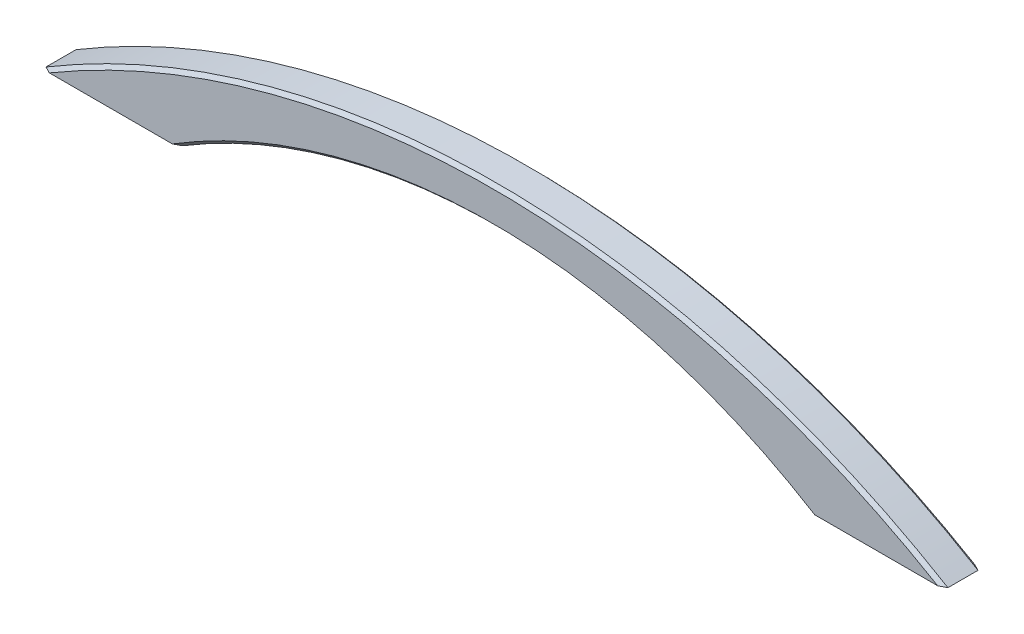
ISO-10303-21;
HEADER;
FILE_DESCRIPTION(('STEP AP214'),'2;1');
FILE_NAME('part.step','',(''),(''),'','','');
FILE_SCHEMA(('AUTOMOTIVE_DESIGN { 1 0 10303 214 1 1 1 1 }'));
ENDSEC;
DATA;
#1=APPLICATION_CONTEXT('core data for automotive mechanical design processes');
#2=APPLICATION_PROTOCOL_DEFINITION('international standard','automotive_design',2000,#1);
#3=PRODUCT_CONTEXT('',#1,'mechanical');
#4=PRODUCT('Part','Part','',(#3));
#5=PRODUCT_RELATED_PRODUCT_CATEGORY('part','',(#4));
#6=PRODUCT_DEFINITION_FORMATION('','',#4);
#7=PRODUCT_DEFINITION_CONTEXT('part definition',#1,'design');
#8=PRODUCT_DEFINITION('design','',#6,#7);
#9=PRODUCT_DEFINITION_SHAPE('','',#8);
#10=(LENGTH_UNIT() NAMED_UNIT(*) SI_UNIT(.MILLI.,.METRE.));
#11=(NAMED_UNIT(*) PLANE_ANGLE_UNIT() SI_UNIT($,.RADIAN.));
#12=(NAMED_UNIT(*) SI_UNIT($,.STERADIAN.) SOLID_ANGLE_UNIT());
#13=UNCERTAINTY_MEASURE_WITH_UNIT(LENGTH_MEASURE(1.E-05),#10,'distance_accuracy_value','');
#14=(GEOMETRIC_REPRESENTATION_CONTEXT(3) GLOBAL_UNCERTAINTY_ASSIGNED_CONTEXT((#13)) GLOBAL_UNIT_ASSIGNED_CONTEXT((#10,
#11,#12)) REPRESENTATION_CONTEXT('',''));
#15=CARTESIAN_POINT('',(0.,0.,0.));
#16=DIRECTION('',(0.,0.,1.));
#17=DIRECTION('',(1.,0.,0.));
#18=AXIS2_PLACEMENT_3D('',#15,#16,#17);
#19=CARTESIAN_POINT('',(0.,-112.184210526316,4.));
#20=DIRECTION('',(0.,0.,-1.));
#21=DIRECTION('',(-1.,0.,0.));
#22=AXIS2_PLACEMENT_3D('',#19,#20,#21);
#23=CYLINDRICAL_SURFACE('',#22,131.184210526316);
#24=DIRECTION('',(0.,0.,-1.));
#25=VECTOR('',#24,1.);
#26=CARTESIAN_POINT('',(-68.,0.,4.));
#27=LINE('',#26,#25);
#28=CARTESIAN_POINT('',(-68.,0.,3.24999999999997));
#29=VERTEX_POINT('',#28);
#30=CARTESIAN_POINT('',(-68.,0.,-3.25));
#31=VERTEX_POINT('',#30);
#32=EDGE_CURVE('E150',#29,#31,#27,.T.);
#33=ORIENTED_EDGE('',*,*,#32,.T.);
#34=CARTESIAN_POINT('',(0.,-112.184210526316,-3.25));
#35=DIRECTION('',(0.,0.,-1.));
#36=DIRECTION('',(-1.,0.,0.));
#37=AXIS2_PLACEMENT_3D('',#34,#35,#36);
#38=CIRCLE('',#37,131.184210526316);
#39=CARTESIAN_POINT('',(68.,0.,-3.25));
#40=VERTEX_POINT('',#39);
#41=EDGE_CURVE('E174',#31,#40,#38,.T.);
#42=ORIENTED_EDGE('',*,*,#41,.T.);
#43=DIRECTION('',(0.,0.,-1.));
#44=VECTOR('',#43,1.);
#45=CARTESIAN_POINT('',(68.,0.,4.));
#46=LINE('',#45,#44);
#47=CARTESIAN_POINT('',(68.,0.,3.24999999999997));
#48=VERTEX_POINT('',#47);
#49=EDGE_CURVE('E167',#48,#40,#46,.T.);
#50=ORIENTED_EDGE('',*,*,#49,.F.);
#51=CARTESIAN_POINT('',(0.,-112.184210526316,3.24999999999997));
#52=DIRECTION('',(0.,0.,-1.));
#53=DIRECTION('',(-1.,0.,0.));
#54=AXIS2_PLACEMENT_3D('',#51,#52,#53);
#55=CIRCLE('',#54,131.184210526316);
#56=EDGE_CURVE('E171',#48,#29,#55,.F.);
#57=ORIENTED_EDGE('',*,*,#56,.T.);
#58=EDGE_LOOP('',(#33,#42,#50,#57));
#59=FACE_BOUND('',#58,.T.);
#60=ADVANCED_FACE('F42',(#59),#23,.F.);
#61=CARTESIAN_POINT('',(97.5,0.,4.));
#62=DIRECTION('',(0.,1.,0.));
#63=DIRECTION('',(-1.,0.,0.));
#64=AXIS2_PLACEMENT_3D('',#61,#62,#63);
#65=PLANE('',#64);
#66=CARTESIAN_POINT('',(75.,1.09878299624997E-13,0.));
#67=DIRECTION('',(0.,-1.,0.));
#68=DIRECTION('',(0.,0.,-1.));
#69=AXIS2_PLACEMENT_3D('',#66,#67,#68);
#70=CIRCLE('',#69,1.64999999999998);
#71=CARTESIAN_POINT('',(75.,1.09878299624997E-13,-1.64999999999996));
#72=VERTEX_POINT('',#71);
#73=EDGE_CURVE('E126',#72,#72,#70,.T.);
#74=ORIENTED_EDGE('',*,*,#73,.F.);
#75=EDGE_LOOP('',(#74));
#76=FACE_BOUND('',#75,.T.);
#77=ORIENTED_EDGE('',*,*,#49,.T.);
#78=CARTESIAN_POINT('',(68.,0.,-3.25));
#79=CARTESIAN_POINT('',(68.2396998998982,0.,-3.37425391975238));
#80=CARTESIAN_POINT('',(68.4792049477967,0.,-3.49888088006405));
#81=CARTESIAN_POINT('',(68.957825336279,0.,-3.74888088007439));
#82=CARTESIAN_POINT('',(69.1969406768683,0.,-3.87425391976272));
#83=CARTESIAN_POINT('',(69.4358611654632,0.,-4.00000000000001));
#84=B_SPLINE_CURVE_WITH_KNOTS('',3,(#78,#79,#80,#81,#82,#83),.UNSPECIFIED.,.F.,.F.,(4,2,4),(0.,
0.809969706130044,1.61993940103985),.UNSPECIFIED.);
#85=CARTESIAN_POINT('',(69.4358611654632,0.,-4.));
#86=VERTEX_POINT('',#85);
#87=EDGE_CURVE('E212',#40,#86,#84,.T.);
#88=ORIENTED_EDGE('',*,*,#87,.T.);
#89=DIRECTION('',(1.,0.,0.));
#90=VECTOR('',#89,1.);
#91=CARTESIAN_POINT('',(97.5,0.,-4.));
#92=LINE('',#91,#90);
#93=CARTESIAN_POINT('',(96.033848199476,0.,-4.));
#94=VERTEX_POINT('',#93);
#95=EDGE_CURVE('E140',#86,#94,#92,.T.);
#96=ORIENTED_EDGE('',*,*,#95,.T.);
#97=CARTESIAN_POINT('',(96.033848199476,0.,-4.));
#98=CARTESIAN_POINT('',(96.2784903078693,0.,-3.87555415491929));
#99=CARTESIAN_POINT('',(96.5229906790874,0.,-3.75083123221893));
#100=CARTESIAN_POINT('',(97.0117079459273,0.,-3.5008312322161));
#101=CARTESIAN_POINT('',(97.2559248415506,0.,-3.37555415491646));
#102=CARTESIAN_POINT('',(97.5,0.,-3.25));
#103=B_SPLINE_CURVE_WITH_KNOTS('',3,(#97,#98,#99,#100,#101,#102),.UNSPECIFIED.,.F.,.F.,(4,2,4),
(0.,0.823423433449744,1.64684686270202),.UNSPECIFIED.);
#104=CARTESIAN_POINT('',(97.5,0.,-3.25000000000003));
#105=VERTEX_POINT('',#104);
#106=EDGE_CURVE('E186',#94,#105,#103,.T.);
#107=ORIENTED_EDGE('',*,*,#106,.T.);
#108=DIRECTION('',(0.,0.,-1.));
#109=VECTOR('',#108,1.);
#110=CARTESIAN_POINT('',(97.5,0.,4.));
#111=LINE('',#110,#109);
#112=CARTESIAN_POINT('',(97.5,0.,3.25000000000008));
#113=VERTEX_POINT('',#112);
#114=EDGE_CURVE('E163',#113,#105,#111,.T.);
#115=ORIENTED_EDGE('',*,*,#114,.F.);
#116=CARTESIAN_POINT('',(97.5,0.,3.25000000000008));
#117=CARTESIAN_POINT('',(97.2559248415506,0.,3.37555415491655));
#118=CARTESIAN_POINT('',(97.0117079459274,0.,3.50083123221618));
#119=CARTESIAN_POINT('',(96.5229906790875,0.,3.75083123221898));
#120=CARTESIAN_POINT('',(96.2784903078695,0.,3.87555415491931));
#121=CARTESIAN_POINT('',(96.0338481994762,0.,3.99999999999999));
#122=B_SPLINE_CURVE_WITH_KNOTS('',3,(#116,#117,#118,#119,#120,#121),.UNSPECIFIED.,.F.,.F.,(4,2,
4),(0.,0.823423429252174,1.64684686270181),.UNSPECIFIED.);
#123=CARTESIAN_POINT('',(96.0338481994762,0.,4.));
#124=VERTEX_POINT('',#123);
#125=EDGE_CURVE('E178',#113,#124,#122,.T.);
#126=ORIENTED_EDGE('',*,*,#125,.T.);
#127=DIRECTION('',(1.,0.,0.));
#128=VECTOR('',#127,1.);
#129=CARTESIAN_POINT('',(97.5,0.,4.));
#130=LINE('',#129,#128);
#131=CARTESIAN_POINT('',(69.4358611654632,0.,4.));
#132=VERTEX_POINT('',#131);
#133=EDGE_CURVE('E141',#132,#124,#130,.T.);
#134=ORIENTED_EDGE('',*,*,#133,.F.);
#135=CARTESIAN_POINT('',(69.4358611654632,0.,4.));
#136=CARTESIAN_POINT('',(69.1969406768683,0.,3.87425391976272));
#137=CARTESIAN_POINT('',(68.957825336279,0.,3.74888088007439));
#138=CARTESIAN_POINT('',(68.4792049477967,0.,3.49888088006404));
#139=CARTESIAN_POINT('',(68.2396998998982,0.,3.37425391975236));
#140=CARTESIAN_POINT('',(68.,0.,3.24999999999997));
#141=B_SPLINE_CURVE_WITH_KNOTS('',3,(#135,#136,#137,#138,#139,#140),.UNSPECIFIED.,.F.,.F.,(4,2,
4),(0.,0.809969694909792,1.61993940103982),.UNSPECIFIED.);
#142=EDGE_CURVE('E205',#132,#48,#141,.T.);
#143=ORIENTED_EDGE('',*,*,#142,.T.);
#144=EDGE_LOOP('',(#77,#88,#96,#107,#115,#126,#134,#143));
#145=FACE_BOUND('',#144,.T.);
#146=ADVANCED_FACE('F192',(#76,#145),#65,.F.);
#147=CARTESIAN_POINT('',(0.,-162.541666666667,4.));
#148=DIRECTION('',(0.,0.,-1.));
#149=DIRECTION('',(-1.,0.,0.));
#150=AXIS2_PLACEMENT_3D('',#147,#148,#149);
#151=CYLINDRICAL_SURFACE('',#150,189.541666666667);
#152=ORIENTED_EDGE('',*,*,#114,.T.);
#153=CARTESIAN_POINT('',(0.,-162.541666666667,-3.25000000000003));
#154=DIRECTION('',(0.,0.,-1.));
#155=DIRECTION('',(-1.,0.,0.));
#156=AXIS2_PLACEMENT_3D('',#153,#154,#155);
#157=CIRCLE('',#156,189.541666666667);
#158=CARTESIAN_POINT('',(-97.5,0.,-3.25000000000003));
#159=VERTEX_POINT('',#158);
#160=EDGE_CURVE('E11',#105,#159,#157,.F.);
#161=ORIENTED_EDGE('',*,*,#160,.T.);
#162=DIRECTION('',(0.,0.,-1.));
#163=VECTOR('',#162,1.);
#164=CARTESIAN_POINT('',(-97.5,0.,4.));
#165=LINE('',#164,#163);
#166=CARTESIAN_POINT('',(-97.5,0.,3.25000000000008));
#167=VERTEX_POINT('',#166);
#168=EDGE_CURVE('E160',#167,#159,#165,.T.);
#169=ORIENTED_EDGE('',*,*,#168,.F.);
#170=CARTESIAN_POINT('',(0.,-162.541666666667,3.25000000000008));
#171=DIRECTION('',(0.,0.,-1.));
#172=DIRECTION('',(-1.,0.,0.));
#173=AXIS2_PLACEMENT_3D('',#170,#171,#172);
#174=CIRCLE('',#173,189.541666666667);
#175=EDGE_CURVE('E53',#167,#113,#174,.T.);
#176=ORIENTED_EDGE('',*,*,#175,.T.);
#177=EDGE_LOOP('',(#152,#161,#169,#176));
#178=FACE_BOUND('',#177,.T.);
#179=ADVANCED_FACE('F197',(#178),#151,.T.);
#180=CARTESIAN_POINT('',(-68.,0.,4.));
#181=DIRECTION('',(0.,1.,0.));
#182=DIRECTION('',(-1.,0.,0.));
#183=AXIS2_PLACEMENT_3D('',#180,#181,#182);
#184=PLANE('',#183);
#185=CARTESIAN_POINT('',(-75.,-1.12584769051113E-13,0.));
#186=DIRECTION('',(0.,-1.,0.));
#187=DIRECTION('',(0.,0.,-1.));
#188=AXIS2_PLACEMENT_3D('',#185,#186,#187);
#189=CIRCLE('',#188,1.64999999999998);
#190=CARTESIAN_POINT('',(-75.,-1.12584769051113E-13,-1.64999999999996));
#191=VERTEX_POINT('',#190);
#192=EDGE_CURVE('E127',#191,#191,#189,.T.);
#193=ORIENTED_EDGE('',*,*,#192,.F.);
#194=EDGE_LOOP('',(#193));
#195=FACE_BOUND('',#194,.T.);
#196=DIRECTION('',(1.,0.,0.));
#197=VECTOR('',#196,1.);
#198=CARTESIAN_POINT('',(-68.,0.,-4.));
#199=LINE('',#198,#197);
#200=CARTESIAN_POINT('',(-96.033848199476,0.,-4.));
#201=VERTEX_POINT('',#200);
#202=CARTESIAN_POINT('',(-69.4358611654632,0.,-4.));
#203=VERTEX_POINT('',#202);
#204=EDGE_CURVE('E146',#201,#203,#199,.T.);
#205=ORIENTED_EDGE('',*,*,#204,.T.);
#206=CARTESIAN_POINT('',(-69.4358611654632,0.,-4.));
#207=CARTESIAN_POINT('',(-69.1969406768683,0.,-3.87425391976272));
#208=CARTESIAN_POINT('',(-68.957825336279,0.,-3.74888088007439));
#209=CARTESIAN_POINT('',(-68.4792049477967,0.,-3.49888088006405));
#210=CARTESIAN_POINT('',(-68.2396998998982,0.,-3.37425391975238));
#211=CARTESIAN_POINT('',(-68.,0.,-3.25));
#212=B_SPLINE_CURVE_WITH_KNOTS('',3,(#206,#207,#208,#209,#210,#211),.UNSPECIFIED.,.F.,.F.,(4,2,
4),(0.,0.809969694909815,1.61993940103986),.UNSPECIFIED.);
#213=EDGE_CURVE('E241',#203,#31,#212,.T.);
#214=ORIENTED_EDGE('',*,*,#213,.T.);
#215=ORIENTED_EDGE('',*,*,#32,.F.);
#216=CARTESIAN_POINT('',(-68.,0.,3.24999999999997));
#217=CARTESIAN_POINT('',(-68.2396998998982,0.,3.37425391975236));
#218=CARTESIAN_POINT('',(-68.4792049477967,0.,3.49888088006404));
#219=CARTESIAN_POINT('',(-68.957825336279,0.,3.74888088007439));
#220=CARTESIAN_POINT('',(-69.1969406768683,0.,3.87425391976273));
#221=CARTESIAN_POINT('',(-69.4358611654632,0.,4.00000000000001));
#222=B_SPLINE_CURVE_WITH_KNOTS('',3,(#216,#217,#218,#219,#220,#221),.UNSPECIFIED.,.F.,.F.,(4,2,
4),(0.,0.809969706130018,1.61993940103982),.UNSPECIFIED.);
#223=CARTESIAN_POINT('',(-69.4358611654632,0.,4.));
#224=VERTEX_POINT('',#223);
#225=EDGE_CURVE('E233',#29,#224,#222,.T.);
#226=ORIENTED_EDGE('',*,*,#225,.T.);
#227=DIRECTION('',(1.,0.,0.));
#228=VECTOR('',#227,1.);
#229=CARTESIAN_POINT('',(-68.,0.,4.));
#230=LINE('',#229,#228);
#231=CARTESIAN_POINT('',(-96.0338481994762,0.,4.));
#232=VERTEX_POINT('',#231);
#233=EDGE_CURVE('E145',#232,#224,#230,.T.);
#234=ORIENTED_EDGE('',*,*,#233,.F.);
#235=CARTESIAN_POINT('',(-96.0338481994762,0.,4.));
#236=CARTESIAN_POINT('',(-96.2784903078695,0.,3.8755541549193));
#237=CARTESIAN_POINT('',(-96.5229906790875,0.,3.75083123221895));
#238=CARTESIAN_POINT('',(-97.0117079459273,0.,3.50083123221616));
#239=CARTESIAN_POINT('',(-97.2559248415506,0.,3.37555415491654));
#240=CARTESIAN_POINT('',(-97.5,0.,3.25000000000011));
#241=B_SPLINE_CURVE_WITH_KNOTS('',3,(#235,#236,#237,#238,#239,#240),.UNSPECIFIED.,.F.,.F.,(4,2,
4),(0.,0.823423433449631,1.64684686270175),.UNSPECIFIED.);
#242=EDGE_CURVE('E67',#232,#167,#241,.T.);
#243=ORIENTED_EDGE('',*,*,#242,.T.);
#244=ORIENTED_EDGE('',*,*,#168,.T.);
#245=CARTESIAN_POINT('',(-97.5,0.,-3.25000000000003));
#246=CARTESIAN_POINT('',(-97.2559248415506,0.,-3.37555415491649));
#247=CARTESIAN_POINT('',(-97.0117079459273,0.,-3.50083123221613));
#248=CARTESIAN_POINT('',(-96.5229906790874,0.,-3.75083123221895));
#249=CARTESIAN_POINT('',(-96.2784903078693,0.,-3.87555415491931));
#250=CARTESIAN_POINT('',(-96.033848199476,0.,-4.00000000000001));
#251=B_SPLINE_CURVE_WITH_KNOTS('',3,(#245,#246,#247,#248,#249,#250),.UNSPECIFIED.,.F.,.F.,(4,2,
4),(0.,0.823423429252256,1.646846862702),.UNSPECIFIED.);
#252=EDGE_CURVE('E60',#159,#201,#251,.T.);
#253=ORIENTED_EDGE('',*,*,#252,.T.);
#254=EDGE_LOOP('',(#205,#214,#215,#226,#234,#243,#244,#253));
#255=FACE_BOUND('',#254,.T.);
#256=ADVANCED_FACE('F252',(#195,#255),#184,.F.);
#257=CARTESIAN_POINT('',(0.,-112.184210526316,4.));
#258=DIRECTION('',(0.,0.,-1.));
#259=DIRECTION('',(-1.,0.,0.));
#260=AXIS2_PLACEMENT_3D('',#257,#258,#259);
#261=PLANE('',#260);
#262=ORIENTED_EDGE('',*,*,#233,.T.);
#263=CARTESIAN_POINT('',(0.,-112.184210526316,4.));
#264=DIRECTION('',(0.,0.,-1.));
#265=DIRECTION('',(-1.,0.,0.));
#266=AXIS2_PLACEMENT_3D('',#263,#264,#265);
#267=CIRCLE('',#266,131.934210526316);
#268=EDGE_CURVE('E289',#224,#132,#267,.T.);
#269=ORIENTED_EDGE('',*,*,#268,.T.);
#270=ORIENTED_EDGE('',*,*,#133,.T.);
#271=CARTESIAN_POINT('',(0.,-162.541666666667,4.));
#272=DIRECTION('',(0.,0.,-1.));
#273=DIRECTION('',(-1.,0.,0.));
#274=AXIS2_PLACEMENT_3D('',#271,#272,#273);
#275=CIRCLE('',#274,188.791666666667);
#276=EDGE_CURVE('E286',#124,#232,#275,.F.);
#277=ORIENTED_EDGE('',*,*,#276,.T.);
#278=EDGE_LOOP('',(#262,#269,#270,#277));
#279=FACE_BOUND('',#278,.T.);
#280=ADVANCED_FACE('F256',(#279),#261,.F.);
#281=CARTESIAN_POINT('',(0.,-112.184210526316,-4.));
#282=DIRECTION('',(0.,0.,-1.));
#283=DIRECTION('',(-1.,0.,0.));
#284=AXIS2_PLACEMENT_3D('',#281,#282,#283);
#285=PLANE('',#284);
#286=ORIENTED_EDGE('',*,*,#95,.F.);
#287=CARTESIAN_POINT('',(0.,-112.184210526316,-4.));
#288=DIRECTION('',(0.,0.,-1.));
#289=DIRECTION('',(-1.,0.,0.));
#290=AXIS2_PLACEMENT_3D('',#287,#288,#289);
#291=CIRCLE('',#290,131.934210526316);
#292=EDGE_CURVE('E269',#86,#203,#291,.F.);
#293=ORIENTED_EDGE('',*,*,#292,.T.);
#294=ORIENTED_EDGE('',*,*,#204,.F.);
#295=CARTESIAN_POINT('',(0.,-162.541666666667,-4.));
#296=DIRECTION('',(0.,0.,-1.));
#297=DIRECTION('',(-1.,0.,0.));
#298=AXIS2_PLACEMENT_3D('',#295,#296,#297);
#299=CIRCLE('',#298,188.791666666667);
#300=EDGE_CURVE('E271',#201,#94,#299,.T.);
#301=ORIENTED_EDGE('',*,*,#300,.T.);
#302=EDGE_LOOP('',(#286,#293,#294,#301));
#303=FACE_BOUND('',#302,.T.);
#304=ADVANCED_FACE('F258',(#303),#285,.T.);
#305=CARTESIAN_POINT('',(75.,6.00000000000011,0.));
#306=DIRECTION('',(0.,-1.,0.));
#307=DIRECTION('',(0.,0.,-1.));
#308=AXIS2_PLACEMENT_3D('',#305,#306,#307);
#309=CONICAL_SURFACE('',#308,1.65,1.02974425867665);
#310=CARTESIAN_POINT('',(75.,6.99142002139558,0.));
#311=VERTEX_POINT('',#310);
#312=VERTEX_LOOP('',#311);
#313=FACE_BOUND('',#312,.T.);
#314=CARTESIAN_POINT('',(75.,6.00000000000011,0.));
#315=DIRECTION('',(0.,-1.,0.));
#316=DIRECTION('',(0.,0.,-1.));
#317=AXIS2_PLACEMENT_3D('',#314,#315,#316);
#318=CIRCLE('',#317,1.65);
#319=CARTESIAN_POINT('',(75.,6.00000000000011,-1.64999999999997));
#320=VERTEX_POINT('',#319);
#321=EDGE_CURVE('E132',#320,#320,#318,.T.);
#322=ORIENTED_EDGE('',*,*,#321,.T.);
#323=EDGE_LOOP('',(#322));
#324=FACE_BOUND('',#323,.T.);
#325=ADVANCED_FACE('F318',(#313,#324),#309,.F.);
#326=CARTESIAN_POINT('',(75.,1.11231534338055E-13,0.));
#327=DIRECTION('',(0.,-1.,0.));
#328=DIRECTION('',(0.,0.,-1.));
#329=AXIS2_PLACEMENT_3D('',#326,#327,#328);
#330=CYLINDRICAL_SURFACE('',#329,1.64999999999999);
#331=ORIENTED_EDGE('',*,*,#321,.F.);
#332=EDGE_LOOP('',(#331));
#333=FACE_BOUND('',#332,.T.);
#334=ORIENTED_EDGE('',*,*,#73,.T.);
#335=EDGE_LOOP('',(#334));
#336=FACE_BOUND('',#335,.T.);
#337=ADVANCED_FACE('F119',(#333,#336),#330,.F.);
#338=CARTESIAN_POINT('',(-75.,5.99999999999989,0.));
#339=DIRECTION('',(0.,-1.,0.));
#340=DIRECTION('',(0.,0.,-1.));
#341=AXIS2_PLACEMENT_3D('',#338,#339,#340);
#342=CONICAL_SURFACE('',#341,1.65,1.02974425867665);
#343=CARTESIAN_POINT('',(-75.,6.99142002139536,0.));
#344=VERTEX_POINT('',#343);
#345=VERTEX_LOOP('',#344);
#346=FACE_BOUND('',#345,.T.);
#347=CARTESIAN_POINT('',(-75.,5.99999999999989,0.));
#348=DIRECTION('',(0.,-1.,0.));
#349=DIRECTION('',(0.,0.,-1.));
#350=AXIS2_PLACEMENT_3D('',#347,#348,#349);
#351=CIRCLE('',#350,1.65);
#352=CARTESIAN_POINT('',(-75.,5.99999999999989,-1.64999999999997));
#353=VERTEX_POINT('',#352);
#354=EDGE_CURVE('E123',#353,#353,#351,.T.);
#355=ORIENTED_EDGE('',*,*,#354,.T.);
#356=EDGE_LOOP('',(#355));
#357=FACE_BOUND('',#356,.T.);
#358=ADVANCED_FACE('F115',(#346,#357),#342,.F.);
#359=CARTESIAN_POINT('',(-75.,-1.11231534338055E-13,0.));
#360=DIRECTION('',(0.,-1.,0.));
#361=DIRECTION('',(0.,0.,-1.));
#362=AXIS2_PLACEMENT_3D('',#359,#360,#361);
#363=CYLINDRICAL_SURFACE('',#362,1.64999999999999);
#364=ORIENTED_EDGE('',*,*,#354,.F.);
#365=EDGE_LOOP('',(#364));
#366=FACE_BOUND('',#365,.T.);
#367=ORIENTED_EDGE('',*,*,#192,.T.);
#368=EDGE_LOOP('',(#367));
#369=FACE_BOUND('',#368,.T.);
#370=ADVANCED_FACE('F118',(#366,#369),#363,.F.);
#371=CARTESIAN_POINT('',(0.,-112.184210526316,-3.25));
#372=DIRECTION('',(0.,0.,-1.));
#373=DIRECTION('',(-1.,0.,0.));
#374=AXIS2_PLACEMENT_3D('',#371,#372,#373);
#375=CONICAL_SURFACE('',#374,131.184210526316,0.785398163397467);
#376=ORIENTED_EDGE('',*,*,#213,.F.);
#377=ORIENTED_EDGE('',*,*,#292,.F.);
#378=ORIENTED_EDGE('',*,*,#87,.F.);
#379=ORIENTED_EDGE('',*,*,#41,.F.);
#380=EDGE_LOOP('',(#376,#377,#378,#379));
#381=FACE_BOUND('',#380,.T.);
#382=ADVANCED_FACE('F227',(#381),#375,.F.);
#383=CARTESIAN_POINT('',(0.,-112.184210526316,4.));
#384=DIRECTION('',(0.,0.,1.));
#385=DIRECTION('',(1.,0.,0.));
#386=AXIS2_PLACEMENT_3D('',#383,#384,#385);
#387=CONICAL_SURFACE('',#386,131.934210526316,0.78539816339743);
#388=ORIENTED_EDGE('',*,*,#225,.F.);
#389=ORIENTED_EDGE('',*,*,#56,.F.);
#390=ORIENTED_EDGE('',*,*,#142,.F.);
#391=ORIENTED_EDGE('',*,*,#268,.F.);
#392=EDGE_LOOP('',(#388,#389,#390,#391));
#393=FACE_BOUND('',#392,.T.);
#394=ADVANCED_FACE('F219',(#393),#387,.F.);
#395=CARTESIAN_POINT('',(0.,-162.541666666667,-3.25000000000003));
#396=DIRECTION('',(0.,0.,1.));
#397=DIRECTION('',(1.,0.,0.));
#398=AXIS2_PLACEMENT_3D('',#395,#396,#397);
#399=CONICAL_SURFACE('',#398,189.541666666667,0.785398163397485);
#400=ORIENTED_EDGE('',*,*,#106,.F.);
#401=ORIENTED_EDGE('',*,*,#300,.F.);
#402=ORIENTED_EDGE('',*,*,#252,.F.);
#403=ORIENTED_EDGE('',*,*,#160,.F.);
#404=EDGE_LOOP('',(#400,#401,#402,#403));
#405=FACE_BOUND('',#404,.T.);
#406=ADVANCED_FACE('F226',(#405),#399,.T.);
#407=CARTESIAN_POINT('',(0.,-162.541666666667,4.));
#408=DIRECTION('',(0.,0.,-1.));
#409=DIRECTION('',(-1.,0.,0.));
#410=AXIS2_PLACEMENT_3D('',#407,#408,#409);
#411=CONICAL_SURFACE('',#410,188.791666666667,0.785398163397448);
#412=ORIENTED_EDGE('',*,*,#125,.F.);
#413=ORIENTED_EDGE('',*,*,#175,.F.);
#414=ORIENTED_EDGE('',*,*,#242,.F.);
#415=ORIENTED_EDGE('',*,*,#276,.F.);
#416=EDGE_LOOP('',(#412,#413,#414,#415));
#417=FACE_BOUND('',#416,.T.);
#418=ADVANCED_FACE('F45',(#417),#411,.T.);
#419=CLOSED_SHELL('',(#60,#146,#179,#256,#280,#304,#325,#337,#358,#370,#382,#394,#406,#418));
#420=MANIFOLD_SOLID_BREP('B2',#419);
#421=ADVANCED_BREP_SHAPE_REPRESENTATION('',(#18,#420),#14);
#422=SHAPE_DEFINITION_REPRESENTATION(#9,#421);
ENDSEC;
END-ISO-10303-21;
